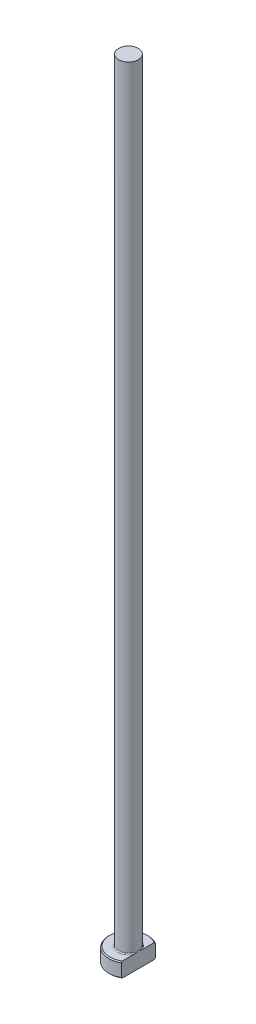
from build123d import *
from build123d.topology import SkipClean

# Parameters (mm, degrees)
CHAMFER1_SIZE = 0.2
FILLET1_R     = 0.2
KEY_DEPTH     = 161.09996877


with BuildPart() as part:
    # Sketch1 → Revolve1 (revolve)
    with BuildSketch(Plane.XY, mode=Mode.PRIVATE) as revolve1_sk:
        Polygon((0, 0), (-4, 0), (-4, 3), (-2, 3), (-2, 160), (0, 160), align=None)
    revolve(revolve1_sk.sketch.rotate(Axis((0, 259.958771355, 0), (0, -1, 0)), 270), axis=Axis((0, 259.958771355, 0), (0, -1, 0)))

    # Chamfer1
    chamfer1_edges = [part.edges().sort_by_distance(p)[0] for p in [
        (0, 3, -4),
        (0, 0, -4),
    ]]
    chamfer(chamfer1_edges, length=CHAMFER1_SIZE)

    # Fillet1
    fillet1_edges = [part.edges().sort_by_distance(p)[0] for p in [
        (0, 3, -2),
    ]]
    fillet(fillet1_edges, radius=FILLET1_R)

    # Sketch2 → KEY (cut, through all)
    with SkipClean():  # the faces are left unmerged after this step: merging them gives an invalid solid
        with BuildSketch(Plane(origin=(0, 0, 0), x_dir=(1, 0, 0), z_dir=(0, 1, 0))):
            with BuildLine():
                Line((2, 3.464101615), (2, -3.464101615))
                ThreePointArc((2, -3.464101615), (4, 0), (2, 3.464101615))
            make_face()
        extrude(amount=KEY_DEPTH, mode=Mode.SUBTRACT)


solid = part.part
